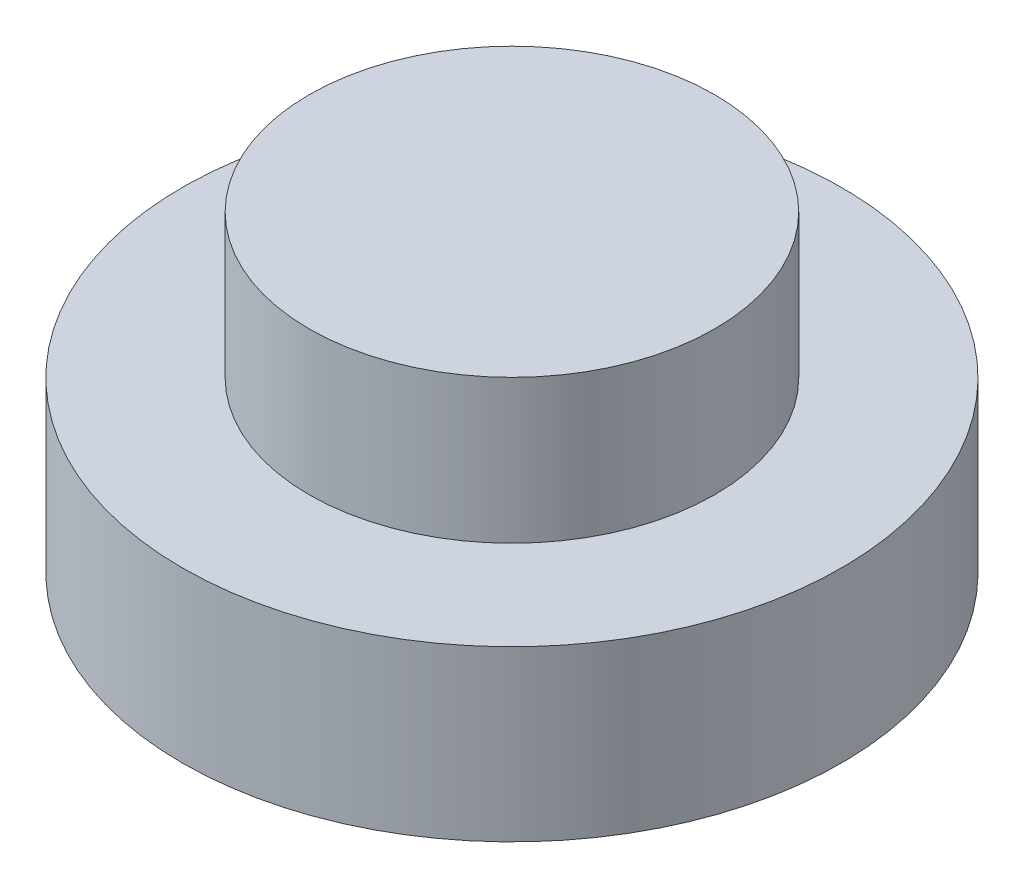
from build123d import *

# Parameters (mm, degrees)
SKETCH1_R           = 3.9
BOSS_EXTRUDE1_DEPTH = 2
SKETCH2_R           = 2.4
BOSS_EXTRUDE2_DEPTH = 1.7
SKETCH3_R           = 2.4
CUT_EXTRUDE1_DEPTH  = 1.7


with BuildPart() as part:
    # Sketch1 → Boss-Extrude1 (new body)
    with BuildSketch(Plane(origin=(0, 0, 0), x_dir=(1, 0, 0), z_dir=(0, 1, 0))):
        with Locations(Location((0, 0, 0), (0, 0, 270))):
            Circle(SKETCH1_R)
    extrude(amount=BOSS_EXTRUDE1_DEPTH)

    # Sketch2 → Boss-Extrude2 (add)
    with BuildSketch(Plane(origin=(0, 2, 0), x_dir=(1, 0, 0), z_dir=(0, 1, 0))):
        with Locations(Location((0, 0, 0), (0, 0, 270))):
            Circle(SKETCH2_R)
    extrude(amount=BOSS_EXTRUDE2_DEPTH)

    # Sketch3 → Cut-Extrude1 (cut)
    with BuildSketch(Plane.XZ):
        with Locations(Location((0, 0, 0), (0, 0, 90))):
            Circle(SKETCH3_R)
    extrude(amount=-CUT_EXTRUDE1_DEPTH, mode=Mode.SUBTRACT)


solid = part.part
